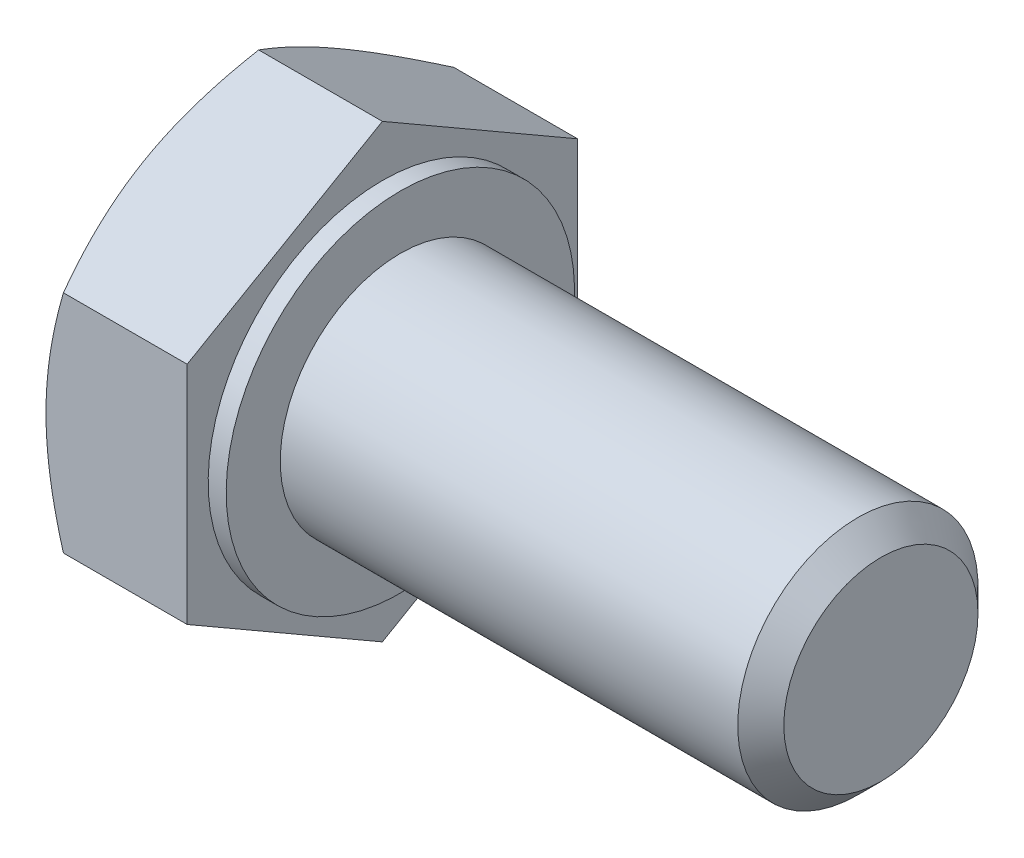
ISO-10303-21;
HEADER;
FILE_DESCRIPTION(('STEP AP214'),'2;1');
FILE_NAME('part.step','',(''),(''),'','','');
FILE_SCHEMA(('AUTOMOTIVE_DESIGN { 1 0 10303 214 1 1 1 1 }'));
ENDSEC;
DATA;
#1=APPLICATION_CONTEXT('core data for automotive mechanical design processes');
#2=APPLICATION_PROTOCOL_DEFINITION('international standard','automotive_design',2000,#1);
#3=PRODUCT_CONTEXT('',#1,'mechanical');
#4=PRODUCT('Part','Part','',(#3));
#5=PRODUCT_RELATED_PRODUCT_CATEGORY('part','',(#4));
#6=PRODUCT_DEFINITION_FORMATION('','',#4);
#7=PRODUCT_DEFINITION_CONTEXT('part definition',#1,'design');
#8=PRODUCT_DEFINITION('design','',#6,#7);
#9=PRODUCT_DEFINITION_SHAPE('','',#8);
#10=(LENGTH_UNIT() NAMED_UNIT(*) SI_UNIT(.MILLI.,.METRE.));
#11=(NAMED_UNIT(*) PLANE_ANGLE_UNIT() SI_UNIT($,.RADIAN.));
#12=(NAMED_UNIT(*) SI_UNIT($,.STERADIAN.) SOLID_ANGLE_UNIT());
#13=UNCERTAINTY_MEASURE_WITH_UNIT(LENGTH_MEASURE(1.E-05),#10,'distance_accuracy_value','');
#14=(GEOMETRIC_REPRESENTATION_CONTEXT(3) GLOBAL_UNCERTAINTY_ASSIGNED_CONTEXT((#13)) GLOBAL_UNIT_ASSIGNED_CONTEXT((#10,
#11,#12)) REPRESENTATION_CONTEXT('',''));
#15=CARTESIAN_POINT('',(0.,0.,0.));
#16=DIRECTION('',(0.,0.,1.));
#17=DIRECTION('',(1.,0.,0.));
#18=AXIS2_PLACEMENT_3D('',#15,#16,#17);
#19=CARTESIAN_POINT('',(-5.30009999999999,0.,0.));
#20=DIRECTION('',(1.,0.,0.));
#21=DIRECTION('',(0.,0.,-1.));
#22=AXIS2_PLACEMENT_3D('',#19,#20,#21);
#23=PLANE('',#22);
#24=CARTESIAN_POINT('',(-5.30010000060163,0.,0.));
#25=DIRECTION('',(1.,0.,0.));
#26=DIRECTION('',(0.,0.,-1.));
#27=AXIS2_PLACEMENT_3D('',#24,#25,#26);
#28=CIRCLE('',#27,6.50000000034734);
#29=CARTESIAN_POINT('',(-5.3001000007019,5.62916512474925,-3.25000000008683));
#30=VERTEX_POINT('',#29);
#31=CARTESIAN_POINT('',(-5.3001000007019,5.62916512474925,3.25000000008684));
#32=VERTEX_POINT('',#31);
#33=EDGE_CURVE('E323',#30,#32,#28,.T.);
#34=ORIENTED_EDGE('',*,*,#33,.F.);
#35=CARTESIAN_POINT('',(-5.30010000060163,0.,0.));
#36=DIRECTION('',(1.,0.,0.));
#37=DIRECTION('',(0.,0.,-1.));
#38=AXIS2_PLACEMENT_3D('',#35,#36,#37);
#39=CIRCLE('',#38,6.50000000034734);
#40=CARTESIAN_POINT('',(-5.3001000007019,0.,-6.50000000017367));
#41=VERTEX_POINT('',#40);
#42=EDGE_CURVE('E319',#41,#30,#39,.T.);
#43=ORIENTED_EDGE('',*,*,#42,.F.);
#44=CARTESIAN_POINT('',(-5.30010000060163,0.,0.));
#45=DIRECTION('',(1.,0.,0.));
#46=DIRECTION('',(0.,0.,-1.));
#47=AXIS2_PLACEMENT_3D('',#44,#45,#46);
#48=CIRCLE('',#47,6.50000000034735);
#49=CARTESIAN_POINT('',(-5.3001000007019,-5.62916512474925,-3.25000000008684));
#50=VERTEX_POINT('',#49);
#51=EDGE_CURVE('E315',#50,#41,#48,.T.);
#52=ORIENTED_EDGE('',*,*,#51,.F.);
#53=CARTESIAN_POINT('',(-5.30010000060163,0.,0.));
#54=DIRECTION('',(1.,0.,0.));
#55=DIRECTION('',(0.,0.,-1.));
#56=AXIS2_PLACEMENT_3D('',#53,#54,#55);
#57=CIRCLE('',#56,6.50000000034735);
#58=CARTESIAN_POINT('',(-5.3001000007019,-5.62916512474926,3.25000000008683));
#59=VERTEX_POINT('',#58);
#60=EDGE_CURVE('E90',#59,#50,#57,.T.);
#61=ORIENTED_EDGE('',*,*,#60,.F.);
#62=CARTESIAN_POINT('',(-5.30010000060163,0.,0.));
#63=DIRECTION('',(1.,0.,0.));
#64=DIRECTION('',(0.,0.,-1.));
#65=AXIS2_PLACEMENT_3D('',#62,#63,#64);
#66=CIRCLE('',#65,6.50000000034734);
#67=CARTESIAN_POINT('',(-5.3001000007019,0.,6.50000000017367));
#68=VERTEX_POINT('',#67);
#69=EDGE_CURVE('E87',#68,#59,#66,.T.);
#70=ORIENTED_EDGE('',*,*,#69,.F.);
#71=CARTESIAN_POINT('',(-5.30010000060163,0.,0.));
#72=DIRECTION('',(1.,0.,0.));
#73=DIRECTION('',(0.,0.,-1.));
#74=AXIS2_PLACEMENT_3D('',#71,#72,#73);
#75=CIRCLE('',#74,6.50000000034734);
#76=EDGE_CURVE('E19',#32,#68,#75,.T.);
#77=ORIENTED_EDGE('',*,*,#76,.F.);
#78=EDGE_LOOP('',(#34,#43,#52,#61,#70,#77));
#79=FACE_BOUND('',#78,.T.);
#80=ADVANCED_FACE('F16',(#79),#23,.F.);
#81=CARTESIAN_POINT('',(-4.71606007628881,0.,0.));
#82=DIRECTION('',(1.,0.,0.));
#83=DIRECTION('',(0.,0.,-1.));
#84=AXIS2_PLACEMENT_3D('',#81,#82,#83);
#85=CONICAL_SURFACE('',#84,7.51158682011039,1.04719755);
#86=ORIENTED_EDGE('',*,*,#76,.T.);
#87=CARTESIAN_POINT('',(-4.71954341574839,3.75277674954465,6.50000000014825));
#88=CARTESIAN_POINT('',(-4.80774841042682,3.44730232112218,6.50000000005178));
#89=CARTESIAN_POINT('',(-4.88855958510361,3.13938154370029,6.50000000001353));
#90=CARTESIAN_POINT('',(-5.03106863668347,2.52082569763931,6.49999999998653));
#91=CARTESIAN_POINT('',(-5.09286102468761,2.2102122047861,6.49999999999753));
#92=CARTESIAN_POINT('',(-5.16873158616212,1.74136052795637,6.50000000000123));
#93=CARTESIAN_POINT('',(-5.19122798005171,1.58448437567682,6.50000000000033));
#94=CARTESIAN_POINT('',(-5.23016970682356,1.26998104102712,6.49999999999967));
#95=CARTESIAN_POINT('',(-5.24661519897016,1.11235387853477,6.4999999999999));
#96=CARTESIAN_POINT('',(-5.27316617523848,0.795765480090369,6.50000000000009));
#97=CARTESIAN_POINT('',(-5.28323941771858,0.636801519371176,6.50000000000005));
#98=CARTESIAN_POINT('',(-5.29672027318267,0.31856096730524,6.49999999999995));
#99=CARTESIAN_POINT('',(-5.30012656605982,0.159284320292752,6.4999999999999));
#100=CARTESIAN_POINT('',(-5.30010000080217,1.44683826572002E-11,6.5));
#101=B_SPLINE_CURVE_WITH_KNOTS('',3,(#87,#88,#89,#90,#91,#92,#93,#94,#95,#96,#97,#98,#99,#100),
.UNSPECIFIED.,.F.,.F.,(4,2,2,2,2,2,4),(0.,0.95424765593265,1.90367376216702,2.37900973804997,
2.85433320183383,3.33204281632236,3.80984701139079),.UNSPECIFIED.);
#102=CARTESIAN_POINT('',(-4.71954341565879,3.75277674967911,6.49999999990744));
#103=VERTEX_POINT('',#102);
#104=EDGE_CURVE('E108',#103,#68,#101,.T.);
#105=ORIENTED_EDGE('',*,*,#104,.F.);
#106=CARTESIAN_POINT('',(-5.30010000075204,5.62916512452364,3.24999999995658));
#107=CARTESIAN_POINT('',(-5.30012656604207,5.54952296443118,3.38794426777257));
#108=CARTESIAN_POINT('',(-5.29672027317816,5.4698846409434,3.52588189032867));
#109=CARTESIAN_POINT('',(-5.28323941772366,5.31076436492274,3.80148629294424));
#110=CARTESIAN_POINT('',(-5.27316617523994,5.231282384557,3.93915312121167));
#111=CARTESIAN_POINT('',(-5.24661519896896,5.07298818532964,4.21332671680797));
#112=CARTESIAN_POINT('',(-5.23016970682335,4.99417460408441,4.34983584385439));
#113=CARTESIAN_POINT('',(-5.19122798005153,4.8369229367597,4.62220372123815));
#114=CARTESIAN_POINT('',(-5.16873158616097,4.75848486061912,4.75806245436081));
#115=CARTESIAN_POINT('',(-5.09286102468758,4.52405902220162,5.16409991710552));
#116=CARTESIAN_POINT('',(-5.03106863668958,4.36875227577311,5.43309909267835));
#117=CARTESIAN_POINT('',(-4.88855958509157,4.059474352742,5.96878416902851));
#118=CARTESIAN_POINT('',(-4.80774841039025,3.90551396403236,6.23545138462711));
#119=CARTESIAN_POINT('',(-4.71954341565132,3.7527767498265,6.49999999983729));
#120=B_SPLINE_CURVE_WITH_KNOTS('',3,(#106,#107,#108,#109,#110,#111,#112,#113,#114,#115,#116,
#117,#118,#119),.UNSPECIFIED.,.F.,.F.,(4,2,2,2,2,2,4),(0.,0.477804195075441,0.955513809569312,
1.43083727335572,1.90617324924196,2.85559935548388,3.80984701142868),.UNSPECIFIED.);
#121=EDGE_CURVE('E102',#32,#103,#120,.T.);
#122=ORIENTED_EDGE('',*,*,#121,.F.);
#123=EDGE_LOOP('',(#86,#105,#122));
#124=FACE_BOUND('',#123,.T.);
#125=ADVANCED_FACE('F107',(#124),#85,.T.);
#126=CARTESIAN_POINT('',(-4.71606007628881,0.,0.));
#127=DIRECTION('',(1.,0.,0.));
#128=DIRECTION('',(0.,0.,-1.));
#129=AXIS2_PLACEMENT_3D('',#126,#127,#128);
#130=CONICAL_SURFACE('',#129,7.51158682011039,1.04719755);
#131=CARTESIAN_POINT('',(-5.30010000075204,0.,6.49999999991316));
#132=CARTESIAN_POINT('',(-5.30012656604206,-0.159284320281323,6.49999999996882));
#133=CARTESIAN_POINT('',(-5.29672027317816,-0.318560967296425,6.49999999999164));
#134=CARTESIAN_POINT('',(-5.28323941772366,-0.636801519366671,6.50000000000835));
#135=CARTESIAN_POINT('',(-5.27316617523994,-0.795765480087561,6.50000000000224));
#136=CARTESIAN_POINT('',(-5.24661519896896,-1.11235387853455,6.49999999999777));
#137=CARTESIAN_POINT('',(-5.23016970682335,-1.26998104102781,6.49999999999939));
#138=CARTESIAN_POINT('',(-5.19122798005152,-1.58448437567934,6.50000000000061));
#139=CARTESIAN_POINT('',(-5.16873158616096,-1.74136052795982,6.50000000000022));
#140=CARTESIAN_POINT('',(-5.09286102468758,-2.21021220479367,6.49999999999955));
#141=CARTESIAN_POINT('',(-5.03106863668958,-2.52082569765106,6.49999999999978));
#142=CARTESIAN_POINT('',(-4.88855958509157,-3.13938154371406,6.50000000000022));
#143=CARTESIAN_POINT('',(-4.80774841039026,-3.44730232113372,6.50000000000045));
#144=CARTESIAN_POINT('',(-4.71954341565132,-3.75277674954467,6.5));
#145=B_SPLINE_CURVE_WITH_KNOTS('',3,(#131,#132,#133,#134,#135,#136,#137,#138,#139,#140,#141,
#142,#143,#144),.UNSPECIFIED.,.F.,.F.,(4,2,2,2,2,2,4),(0.,0.477804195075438,0.955513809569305,
1.43083727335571,1.90617324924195,2.85559935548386,3.80984701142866),.UNSPECIFIED.);
#146=CARTESIAN_POINT('',(-4.71954341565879,-3.75277674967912,6.49999999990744));
#147=VERTEX_POINT('',#146);
#148=EDGE_CURVE('E95',#68,#147,#145,.T.);
#149=ORIENTED_EDGE('',*,*,#148,.F.);
#150=ORIENTED_EDGE('',*,*,#69,.T.);
#151=CARTESIAN_POINT('',(-4.71954341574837,-3.75277674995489,6.49999999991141));
#152=CARTESIAN_POINT('',(-4.80774841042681,-3.90551396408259,6.23545138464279));
#153=CARTESIAN_POINT('',(-4.8885595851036,-4.05947435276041,5.96878416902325));
#154=CARTESIAN_POINT('',(-5.03106863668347,-4.36875227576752,5.43309909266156));
#155=CARTESIAN_POINT('',(-5.09286102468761,-4.52405902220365,5.16409991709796));
#156=CARTESIAN_POINT('',(-5.16873158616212,-4.75848486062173,4.75806245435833));
#157=CARTESIAN_POINT('',(-5.19122798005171,-4.83692293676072,4.62220372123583));
#158=CARTESIAN_POINT('',(-5.23016970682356,-4.99417460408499,4.34983584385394));
#159=CARTESIAN_POINT('',(-5.24661519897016,-5.07298818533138,4.21332671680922));
#160=CARTESIAN_POINT('',(-5.27316617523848,-5.23128238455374,3.93915312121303));
#161=CARTESIAN_POINT('',(-5.28323941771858,-5.3107643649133,3.80148629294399));
#162=CARTESIAN_POINT('',(-5.29672027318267,-5.46988464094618,3.52588189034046));
#163=CARTESIAN_POINT('',(-5.30012656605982,-5.54952296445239,3.38794426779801));
#164=CARTESIAN_POINT('',(-5.30010000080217,-5.62916512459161,3.25000000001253));
#165=B_SPLINE_CURVE_WITH_KNOTS('',3,(#151,#152,#153,#154,#155,#156,#157,#158,#159,#160,#161,
#162,#163,#164),.UNSPECIFIED.,.F.,.F.,(4,2,2,2,2,2,4),(0.,0.954247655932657,1.90367376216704,
2.37900973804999,2.85433320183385,3.33204281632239,3.80984701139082),.UNSPECIFIED.);
#166=EDGE_CURVE('E97',#147,#59,#165,.T.);
#167=ORIENTED_EDGE('',*,*,#166,.F.);
#168=EDGE_LOOP('',(#149,#150,#167));
#169=FACE_BOUND('',#168,.T.);
#170=ADVANCED_FACE('F96',(#169),#130,.T.);
#171=CARTESIAN_POINT('',(-4.71606007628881,0.,0.));
#172=DIRECTION('',(1.,0.,0.));
#173=DIRECTION('',(0.,0.,-1.));
#174=AXIS2_PLACEMENT_3D('',#171,#172,#173);
#175=CONICAL_SURFACE('',#174,7.51158682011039,1.04719755);
#176=CARTESIAN_POINT('',(-5.30010000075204,-5.62916512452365,3.24999999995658));
#177=CARTESIAN_POINT('',(-5.30012656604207,-5.7088072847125,3.11205573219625));
#178=CARTESIAN_POINT('',(-5.29672027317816,-5.78844560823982,2.97411810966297));
#179=CARTESIAN_POINT('',(-5.28323941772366,-5.94756588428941,2.69851370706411));
#180=CARTESIAN_POINT('',(-5.27316617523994,-6.02704786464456,2.56084687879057));
#181=CARTESIAN_POINT('',(-5.24661519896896,-6.18534206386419,2.28667328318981));
#182=CARTESIAN_POINT('',(-5.23016970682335,-6.26415564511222,2.150164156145));
#183=CARTESIAN_POINT('',(-5.19122798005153,-6.42140731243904,1.87779627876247));
#184=CARTESIAN_POINT('',(-5.16873158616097,-6.49984538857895,1.74193754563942));
#185=CARTESIAN_POINT('',(-5.09286102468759,-6.7342712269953,1.33590008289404));
#186=CARTESIAN_POINT('',(-5.03106863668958,-6.88957797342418,1.06690090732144));
#187=CARTESIAN_POINT('',(-4.88855958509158,-7.19885589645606,0.531215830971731));
#188=CARTESIAN_POINT('',(-4.80774841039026,-7.35281628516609,0.264548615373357));
#189=CARTESIAN_POINT('',(-4.71954341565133,-7.50555349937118,1.6272616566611E-10));
#190=B_SPLINE_CURVE_WITH_KNOTS('',3,(#176,#177,#178,#179,#180,#181,#182,#183,#184,#185,#186,
#187,#188,#189),.UNSPECIFIED.,.F.,.F.,(4,2,2,2,2,2,4),(0.,0.477804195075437,0.955513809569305,
1.43083727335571,1.90617324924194,2.85559935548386,3.80984701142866),.UNSPECIFIED.);
#191=CARTESIAN_POINT('',(-4.71954341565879,-7.50555349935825,0.));
#192=VERTEX_POINT('',#191);
#193=EDGE_CURVE('E113',#59,#192,#190,.T.);
#194=ORIENTED_EDGE('',*,*,#193,.F.);
#195=ORIENTED_EDGE('',*,*,#60,.T.);
#196=CARTESIAN_POINT('',(-4.71954341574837,-7.50555349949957,-2.36832132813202E-10));
#197=CARTESIAN_POINT('',(-4.80774841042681,-7.3528162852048,-0.264548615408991));
#198=CARTESIAN_POINT('',(-4.8885595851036,-7.19885589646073,-0.531215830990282));
#199=CARTESIAN_POINT('',(-5.03106863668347,-6.88957797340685,-1.06690090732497));
#200=CARTESIAN_POINT('',(-5.09286102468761,-6.73427122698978,-1.33590008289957));
#201=CARTESIAN_POINT('',(-5.16873158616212,-6.49984538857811,-1.7419375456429));
#202=CARTESIAN_POINT('',(-5.19122798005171,-6.42140731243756,-1.8777962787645));
#203=CARTESIAN_POINT('',(-5.23016970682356,-6.26415564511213,-2.15016415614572));
#204=CARTESIAN_POINT('',(-5.24661519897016,-6.18534206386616,-2.28667328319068));
#205=CARTESIAN_POINT('',(-5.27316617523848,-6.02704786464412,-2.56084687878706));
#206=CARTESIAN_POINT('',(-5.28323941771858,-5.94756588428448,-2.69851370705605));
#207=CARTESIAN_POINT('',(-5.29672027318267,-5.78844560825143,-2.97411810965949));
#208=CARTESIAN_POINT('',(-5.30012656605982,-5.70880728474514,-3.11205573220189));
#209=CARTESIAN_POINT('',(-5.30010000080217,-5.62916512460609,-3.24999999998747));
#210=B_SPLINE_CURVE_WITH_KNOTS('',3,(#196,#197,#198,#199,#200,#201,#202,#203,#204,#205,#206,
#207,#208,#209),.UNSPECIFIED.,.F.,.F.,(4,2,2,2,2,2,4),(0.,0.954247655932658,1.90367376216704,
2.37900973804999,2.85433320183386,3.33204281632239,3.80984701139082),.UNSPECIFIED.);
#211=EDGE_CURVE('E207',#192,#50,#210,.T.);
#212=ORIENTED_EDGE('',*,*,#211,.F.);
#213=EDGE_LOOP('',(#194,#195,#212));
#214=FACE_BOUND('',#213,.T.);
#215=ADVANCED_FACE('F215',(#214),#175,.T.);
#216=CARTESIAN_POINT('',(-4.71606007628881,0.,0.));
#217=DIRECTION('',(1.,0.,0.));
#218=DIRECTION('',(0.,0.,-1.));
#219=AXIS2_PLACEMENT_3D('',#216,#217,#218);
#220=CONICAL_SURFACE('',#219,7.51158682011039,1.04719755);
#221=CARTESIAN_POINT('',(-5.30010000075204,-5.62916512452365,-3.24999999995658));
#222=CARTESIAN_POINT('',(-5.30012656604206,-5.54952296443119,-3.38794426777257));
#223=CARTESIAN_POINT('',(-5.29672027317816,-5.46988464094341,-3.52588189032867));
#224=CARTESIAN_POINT('',(-5.28323941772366,-5.31076436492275,-3.80148629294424));
#225=CARTESIAN_POINT('',(-5.27316617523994,-5.23128238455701,-3.93915312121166));
#226=CARTESIAN_POINT('',(-5.24661519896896,-5.07298818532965,-4.21332671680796));
#227=CARTESIAN_POINT('',(-5.23016970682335,-4.99417460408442,-4.34983584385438));
#228=CARTESIAN_POINT('',(-5.19122798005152,-4.83692293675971,-4.62220372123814));
#229=CARTESIAN_POINT('',(-5.16873158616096,-4.75848486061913,-4.7580624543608));
#230=CARTESIAN_POINT('',(-5.09286102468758,-4.52405902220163,-5.16409991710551));
#231=CARTESIAN_POINT('',(-5.03106863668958,-4.36875227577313,-5.43309909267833));
#232=CARTESIAN_POINT('',(-4.88855958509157,-4.05947435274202,-5.96878416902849));
#233=CARTESIAN_POINT('',(-4.80774841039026,-3.90551396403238,-6.23545138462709));
#234=CARTESIAN_POINT('',(-4.71954341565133,-3.75277674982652,-6.49999999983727));
#235=B_SPLINE_CURVE_WITH_KNOTS('',3,(#221,#222,#223,#224,#225,#226,#227,#228,#229,#230,#231,
#232,#233,#234),.UNSPECIFIED.,.F.,.F.,(4,2,2,2,2,2,4),(0.,0.477804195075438,0.955513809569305,
1.43083727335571,1.90617324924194,2.85559935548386,3.80984701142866),.UNSPECIFIED.);
#236=CARTESIAN_POINT('',(-4.71954341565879,-3.75277674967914,-6.49999999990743));
#237=VERTEX_POINT('',#236);
#238=EDGE_CURVE('E219',#50,#237,#235,.T.);
#239=ORIENTED_EDGE('',*,*,#238,.F.);
#240=ORIENTED_EDGE('',*,*,#51,.T.);
#241=CARTESIAN_POINT('',(-4.71954341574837,-3.75277674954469,-6.50000000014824));
#242=CARTESIAN_POINT('',(-4.8077484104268,-3.44730232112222,-6.50000000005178));
#243=CARTESIAN_POINT('',(-4.8885595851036,-3.13938154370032,-6.50000000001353));
#244=CARTESIAN_POINT('',(-5.03106863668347,-2.52082569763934,-6.49999999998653));
#245=CARTESIAN_POINT('',(-5.09286102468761,-2.21021220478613,-6.49999999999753));
#246=CARTESIAN_POINT('',(-5.16873158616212,-1.74136052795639,-6.50000000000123));
#247=CARTESIAN_POINT('',(-5.19122798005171,-1.58448437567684,-6.50000000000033));
#248=CARTESIAN_POINT('',(-5.23016970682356,-1.26998104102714,-6.49999999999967));
#249=CARTESIAN_POINT('',(-5.24661519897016,-1.11235387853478,-6.4999999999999));
#250=CARTESIAN_POINT('',(-5.27316617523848,-0.795765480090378,-6.50000000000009));
#251=CARTESIAN_POINT('',(-5.28323941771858,-0.636801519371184,-6.50000000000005));
#252=CARTESIAN_POINT('',(-5.29672027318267,-0.318560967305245,-6.49999999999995));
#253=CARTESIAN_POINT('',(-5.30012656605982,-0.159284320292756,-6.4999999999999));
#254=CARTESIAN_POINT('',(-5.30010000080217,-1.4470694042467E-11,-6.5));
#255=B_SPLINE_CURVE_WITH_KNOTS('',3,(#241,#242,#243,#244,#245,#246,#247,#248,#249,#250,#251,
#252,#253,#254),.UNSPECIFIED.,.F.,.F.,(4,2,2,2,2,2,4),(0.,0.954247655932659,1.90367376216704,
2.37900973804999,2.85433320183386,3.3320428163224,3.80984701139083),.UNSPECIFIED.);
#256=EDGE_CURVE('E201',#237,#41,#255,.T.);
#257=ORIENTED_EDGE('',*,*,#256,.F.);
#258=EDGE_LOOP('',(#239,#240,#257));
#259=FACE_BOUND('',#258,.T.);
#260=ADVANCED_FACE('F212',(#259),#220,.T.);
#261=CARTESIAN_POINT('',(-4.71606007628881,0.,0.));
#262=DIRECTION('',(1.,0.,0.));
#263=DIRECTION('',(0.,0.,-1.));
#264=AXIS2_PLACEMENT_3D('',#261,#262,#263);
#265=CONICAL_SURFACE('',#264,7.51158682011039,1.04719755);
#266=ORIENTED_EDGE('',*,*,#42,.T.);
#267=CARTESIAN_POINT('',(-4.71954341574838,3.75277674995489,-6.49999999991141));
#268=CARTESIAN_POINT('',(-4.80774841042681,3.90551396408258,-6.23545138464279));
#269=CARTESIAN_POINT('',(-4.8885595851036,4.05947435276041,-5.96878416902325));
#270=CARTESIAN_POINT('',(-5.03106863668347,4.36875227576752,-5.43309909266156));
#271=CARTESIAN_POINT('',(-5.09286102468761,4.52405902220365,-5.16409991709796));
#272=CARTESIAN_POINT('',(-5.16873158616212,4.75848486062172,-4.75806245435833));
#273=CARTESIAN_POINT('',(-5.19122798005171,4.83692293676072,-4.62220372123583));
#274=CARTESIAN_POINT('',(-5.23016970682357,4.99417460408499,-4.34983584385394));
#275=CARTESIAN_POINT('',(-5.24661519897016,5.07298818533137,-4.21332671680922));
#276=CARTESIAN_POINT('',(-5.27316617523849,5.23128238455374,-3.93915312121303));
#277=CARTESIAN_POINT('',(-5.28323941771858,5.3107643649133,-3.80148629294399));
#278=CARTESIAN_POINT('',(-5.29672027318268,5.46988464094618,-3.52588189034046));
#279=CARTESIAN_POINT('',(-5.30012656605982,5.54952296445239,-3.38794426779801));
#280=CARTESIAN_POINT('',(-5.30010000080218,5.62916512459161,-3.25000000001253));
#281=B_SPLINE_CURVE_WITH_KNOTS('',3,(#267,#268,#269,#270,#271,#272,#273,#274,#275,#276,#277,
#278,#279,#280),.UNSPECIFIED.,.F.,.F.,(4,2,2,2,2,2,4),(0.,0.954247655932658,1.90367376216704,
2.37900973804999,2.85433320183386,3.3320428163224,3.80984701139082),.UNSPECIFIED.);
#282=CARTESIAN_POINT('',(-4.71954341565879,3.75277674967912,-6.49999999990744));
#283=VERTEX_POINT('',#282);
#284=EDGE_CURVE('E173',#283,#30,#281,.T.);
#285=ORIENTED_EDGE('',*,*,#284,.F.);
#286=CARTESIAN_POINT('',(-5.30010000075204,0.,-6.49999999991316));
#287=CARTESIAN_POINT('',(-5.30012656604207,0.15928432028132,-6.49999999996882));
#288=CARTESIAN_POINT('',(-5.29672027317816,0.318560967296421,-6.49999999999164));
#289=CARTESIAN_POINT('',(-5.28323941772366,0.636801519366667,-6.50000000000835));
#290=CARTESIAN_POINT('',(-5.27316617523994,0.795765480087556,-6.50000000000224));
#291=CARTESIAN_POINT('',(-5.24661519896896,1.11235387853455,-6.49999999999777));
#292=CARTESIAN_POINT('',(-5.23016970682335,1.26998104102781,-6.49999999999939));
#293=CARTESIAN_POINT('',(-5.19122798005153,1.58448437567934,-6.50000000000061));
#294=CARTESIAN_POINT('',(-5.16873158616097,1.74136052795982,-6.50000000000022));
#295=CARTESIAN_POINT('',(-5.09286102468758,2.21021220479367,-6.49999999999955));
#296=CARTESIAN_POINT('',(-5.03106863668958,2.52082569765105,-6.49999999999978));
#297=CARTESIAN_POINT('',(-4.88855958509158,3.13938154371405,-6.50000000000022));
#298=CARTESIAN_POINT('',(-4.80774841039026,3.44730232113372,-6.50000000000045));
#299=CARTESIAN_POINT('',(-4.71954341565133,3.75277674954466,-6.5));
#300=B_SPLINE_CURVE_WITH_KNOTS('',3,(#286,#287,#288,#289,#290,#291,#292,#293,#294,#295,#296,
#297,#298,#299),.UNSPECIFIED.,.F.,.F.,(4,2,2,2,2,2,4),(0.,0.477804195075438,0.955513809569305,
1.43083727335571,1.90617324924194,2.85559935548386,3.80984701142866),.UNSPECIFIED.);
#301=EDGE_CURVE('E196',#41,#283,#300,.T.);
#302=ORIENTED_EDGE('',*,*,#301,.F.);
#303=EDGE_LOOP('',(#266,#285,#302));
#304=FACE_BOUND('',#303,.T.);
#305=ADVANCED_FACE('F158',(#304),#265,.T.);
#306=CARTESIAN_POINT('',(-4.71606007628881,0.,0.));
#307=DIRECTION('',(1.,0.,0.));
#308=DIRECTION('',(0.,0.,-1.));
#309=AXIS2_PLACEMENT_3D('',#306,#307,#308);
#310=CONICAL_SURFACE('',#309,7.51158682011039,1.04719755);
#311=ORIENTED_EDGE('',*,*,#33,.T.);
#312=CARTESIAN_POINT('',(-4.71954341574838,7.50555349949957,2.36845423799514E-10));
#313=CARTESIAN_POINT('',(-4.80774841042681,7.3528162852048,0.264548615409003));
#314=CARTESIAN_POINT('',(-4.8885595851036,7.19885589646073,0.531215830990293));
#315=CARTESIAN_POINT('',(-5.03106863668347,6.88957797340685,1.06690090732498));
#316=CARTESIAN_POINT('',(-5.09286102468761,6.73427122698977,1.33590008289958));
#317=CARTESIAN_POINT('',(-5.16873158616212,6.49984538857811,1.74193754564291));
#318=CARTESIAN_POINT('',(-5.19122798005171,6.42140731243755,1.8777962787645));
#319=CARTESIAN_POINT('',(-5.23016970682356,6.26415564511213,2.15016415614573));
#320=CARTESIAN_POINT('',(-5.24661519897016,6.18534206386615,2.28667328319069));
#321=CARTESIAN_POINT('',(-5.27316617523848,6.02704786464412,2.56084687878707));
#322=CARTESIAN_POINT('',(-5.28323941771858,5.94756588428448,2.69851370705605));
#323=CARTESIAN_POINT('',(-5.29672027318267,5.78844560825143,2.97411810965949));
#324=CARTESIAN_POINT('',(-5.30012656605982,5.70880728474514,3.11205573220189));
#325=CARTESIAN_POINT('',(-5.30010000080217,5.62916512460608,3.24999999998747));
#326=B_SPLINE_CURVE_WITH_KNOTS('',3,(#312,#313,#314,#315,#316,#317,#318,#319,#320,#321,#322,
#323,#324,#325),.UNSPECIFIED.,.F.,.F.,(4,2,2,2,2,2,4),(0.,0.954247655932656,1.90367376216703,
2.37900973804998,2.85433320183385,3.33204281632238,3.80984701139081),.UNSPECIFIED.);
#327=CARTESIAN_POINT('',(-4.71954341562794,7.50555349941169,9.25589075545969E-11));
#328=VERTEX_POINT('',#327);
#329=EDGE_CURVE('E143',#328,#32,#326,.T.);
#330=ORIENTED_EDGE('',*,*,#329,.F.);
#331=CARTESIAN_POINT('',(-5.30010000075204,5.62916512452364,-3.24999999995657));
#332=CARTESIAN_POINT('',(-5.30012656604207,5.7088072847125,-3.11205573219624));
#333=CARTESIAN_POINT('',(-5.29672027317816,5.78844560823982,-2.97411810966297));
#334=CARTESIAN_POINT('',(-5.28323941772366,5.94756588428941,-2.69851370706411));
#335=CARTESIAN_POINT('',(-5.27316617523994,6.02704786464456,-2.56084687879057));
#336=CARTESIAN_POINT('',(-5.24661519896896,6.1853420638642,-2.28667328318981));
#337=CARTESIAN_POINT('',(-5.23016970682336,6.26415564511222,-2.150164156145));
#338=CARTESIAN_POINT('',(-5.19122798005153,6.42140731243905,-1.87779627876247));
#339=CARTESIAN_POINT('',(-5.16873158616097,6.49984538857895,-1.74193754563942));
#340=CARTESIAN_POINT('',(-5.09286102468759,6.7342712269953,-1.33590008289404));
#341=CARTESIAN_POINT('',(-5.03106863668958,6.88957797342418,-1.06690090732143));
#342=CARTESIAN_POINT('',(-4.88855958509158,7.19885589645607,-0.531215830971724));
#343=CARTESIAN_POINT('',(-4.80774841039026,7.3528162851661,-0.264548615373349));
#344=CARTESIAN_POINT('',(-4.71954341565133,7.50555349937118,-1.62717065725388E-10));
#345=B_SPLINE_CURVE_WITH_KNOTS('',3,(#331,#332,#333,#334,#335,#336,#337,#338,#339,#340,#341,
#342,#343,#344),.UNSPECIFIED.,.F.,.F.,(4,2,2,2,2,2,4),(0.,0.477804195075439,0.955513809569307,
1.43083727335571,1.90617324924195,2.85559935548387,3.80984701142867),.UNSPECIFIED.);
#346=EDGE_CURVE('E164',#30,#328,#345,.T.);
#347=ORIENTED_EDGE('',*,*,#346,.F.);
#348=EDGE_LOOP('',(#311,#330,#347));
#349=FACE_BOUND('',#348,.T.);
#350=ADVANCED_FACE('F152',(#349),#310,.T.);
#351=CARTESIAN_POINT('',(-0.600099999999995,7.50555349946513,0.));
#352=DIRECTION('',(0.,0.866025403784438,0.500000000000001));
#353=DIRECTION('',(0.,-0.500000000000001,0.866025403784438));
#354=AXIS2_PLACEMENT_3D('',#351,#352,#353);
#355=PLANE('',#354);
#356=DIRECTION('',(0.,-0.500000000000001,0.866025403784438));
#357=VECTOR('',#356,1.);
#358=CARTESIAN_POINT('',(-0.600099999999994,7.50555349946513,0.));
#359=LINE('',#358,#357);
#360=CARTESIAN_POINT('',(-0.600099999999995,7.50555349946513,0.));
#361=VERTEX_POINT('',#360);
#362=CARTESIAN_POINT('',(-0.600099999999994,3.75277674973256,6.5));
#363=VERTEX_POINT('',#362);
#364=EDGE_CURVE('E284',#361,#363,#359,.T.);
#365=ORIENTED_EDGE('',*,*,#364,.F.);
#366=DIRECTION('',(1.,0.,0.));
#367=VECTOR('',#366,1.);
#368=CARTESIAN_POINT('',(-0.600099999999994,7.50555349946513,0.));
#369=LINE('',#368,#367);
#370=EDGE_CURVE('E172',#328,#361,#369,.T.);
#371=ORIENTED_EDGE('',*,*,#370,.F.);
#372=ORIENTED_EDGE('',*,*,#329,.T.);
#373=ORIENTED_EDGE('',*,*,#121,.T.);
#374=DIRECTION('',(1.,0.,0.));
#375=VECTOR('',#374,1.);
#376=CARTESIAN_POINT('',(-0.600099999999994,3.75277674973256,6.5));
#377=LINE('',#376,#375);
#378=EDGE_CURVE('E101',#363,#103,#377,.F.);
#379=ORIENTED_EDGE('',*,*,#378,.F.);
#380=EDGE_LOOP('',(#365,#371,#372,#373,#379));
#381=FACE_BOUND('',#380,.T.);
#382=ADVANCED_FACE('F149',(#381),#355,.T.);
#383=CARTESIAN_POINT('',(-0.600099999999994,3.75277674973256,6.5));
#384=DIRECTION('',(0.,0.,1.));
#385=DIRECTION('',(1.,0.,0.));
#386=AXIS2_PLACEMENT_3D('',#383,#384,#385);
#387=PLANE('',#386);
#388=ORIENTED_EDGE('',*,*,#378,.T.);
#389=ORIENTED_EDGE('',*,*,#104,.T.);
#390=ORIENTED_EDGE('',*,*,#148,.T.);
#391=DIRECTION('',(1.,0.,0.));
#392=VECTOR('',#391,1.);
#393=CARTESIAN_POINT('',(-0.600099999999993,-3.75277674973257,6.49999999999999));
#394=LINE('',#393,#392);
#395=CARTESIAN_POINT('',(-0.600099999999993,-3.75277674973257,6.5));
#396=VERTEX_POINT('',#395);
#397=EDGE_CURVE('E115',#396,#147,#394,.F.);
#398=ORIENTED_EDGE('',*,*,#397,.F.);
#399=DIRECTION('',(0.,1.,0.));
#400=VECTOR('',#399,1.);
#401=CARTESIAN_POINT('',(-0.600099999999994,0.,6.5));
#402=LINE('',#401,#400);
#403=EDGE_CURVE('E280',#363,#396,#402,.F.);
#404=ORIENTED_EDGE('',*,*,#403,.F.);
#405=EDGE_LOOP('',(#388,#389,#390,#398,#404));
#406=FACE_BOUND('',#405,.T.);
#407=ADVANCED_FACE('F111',(#406),#387,.T.);
#408=CARTESIAN_POINT('',(-0.600099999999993,-3.75277674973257,6.49999999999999));
#409=DIRECTION('',(0.,-0.866025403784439,0.499999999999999));
#410=DIRECTION('',(0.,-0.499999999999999,-0.866025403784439));
#411=AXIS2_PLACEMENT_3D('',#408,#409,#410);
#412=PLANE('',#411);
#413=ORIENTED_EDGE('',*,*,#397,.T.);
#414=ORIENTED_EDGE('',*,*,#166,.T.);
#415=ORIENTED_EDGE('',*,*,#193,.T.);
#416=DIRECTION('',(1.,0.,0.));
#417=VECTOR('',#416,1.);
#418=CARTESIAN_POINT('',(-0.600099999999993,-7.50555349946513,0.));
#419=LINE('',#418,#417);
#420=CARTESIAN_POINT('',(-0.600099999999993,-7.50555349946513,0.));
#421=VERTEX_POINT('',#420);
#422=EDGE_CURVE('E224',#421,#192,#419,.F.);
#423=ORIENTED_EDGE('',*,*,#422,.F.);
#424=DIRECTION('',(0.,-0.499999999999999,-0.866025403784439));
#425=VECTOR('',#424,1.);
#426=CARTESIAN_POINT('',(-0.600099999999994,-3.75277674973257,6.49999999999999));
#427=LINE('',#426,#425);
#428=EDGE_CURVE('E283',#396,#421,#427,.T.);
#429=ORIENTED_EDGE('',*,*,#428,.F.);
#430=EDGE_LOOP('',(#413,#414,#415,#423,#429));
#431=FACE_BOUND('',#430,.T.);
#432=ADVANCED_FACE('F228',(#431),#412,.T.);
#433=CARTESIAN_POINT('',(-0.600099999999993,-7.50555349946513,0.));
#434=DIRECTION('',(0.,-0.866025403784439,-0.5));
#435=DIRECTION('',(0.,0.5,-0.866025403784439));
#436=AXIS2_PLACEMENT_3D('',#433,#434,#435);
#437=PLANE('',#436);
#438=ORIENTED_EDGE('',*,*,#422,.T.);
#439=ORIENTED_EDGE('',*,*,#211,.T.);
#440=ORIENTED_EDGE('',*,*,#238,.T.);
#441=DIRECTION('',(-1.,0.,0.));
#442=VECTOR('',#441,1.);
#443=CARTESIAN_POINT('',(-0.600099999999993,-3.75277674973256,-6.5));
#444=LINE('',#443,#442);
#445=CARTESIAN_POINT('',(-0.600099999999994,-3.75277674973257,-6.5));
#446=VERTEX_POINT('',#445);
#447=EDGE_CURVE('E300',#446,#237,#444,.T.);
#448=ORIENTED_EDGE('',*,*,#447,.F.);
#449=DIRECTION('',(0.,0.5,-0.866025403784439));
#450=VECTOR('',#449,1.);
#451=CARTESIAN_POINT('',(-0.600099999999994,-7.50555349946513,0.));
#452=LINE('',#451,#450);
#453=EDGE_CURVE('E287',#421,#446,#452,.T.);
#454=ORIENTED_EDGE('',*,*,#453,.F.);
#455=EDGE_LOOP('',(#438,#439,#440,#448,#454));
#456=FACE_BOUND('',#455,.T.);
#457=ADVANCED_FACE('F193',(#456),#437,.T.);
#458=CARTESIAN_POINT('',(-0.600099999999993,-3.75277674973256,-6.5));
#459=DIRECTION('',(0.,0.,-1.));
#460=DIRECTION('',(-1.,0.,0.));
#461=AXIS2_PLACEMENT_3D('',#458,#459,#460);
#462=PLANE('',#461);
#463=DIRECTION('',(0.,1.,0.));
#464=VECTOR('',#463,1.);
#465=CARTESIAN_POINT('',(-0.600099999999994,0.,-6.5));
#466=LINE('',#465,#464);
#467=CARTESIAN_POINT('',(-0.600099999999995,3.75277674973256,-6.49999999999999));
#468=VERTEX_POINT('',#467);
#469=EDGE_CURVE('E290',#446,#468,#466,.T.);
#470=ORIENTED_EDGE('',*,*,#469,.F.);
#471=ORIENTED_EDGE('',*,*,#447,.T.);
#472=ORIENTED_EDGE('',*,*,#256,.T.);
#473=ORIENTED_EDGE('',*,*,#301,.T.);
#474=DIRECTION('',(1.,0.,0.));
#475=VECTOR('',#474,1.);
#476=CARTESIAN_POINT('',(-0.600099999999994,3.75277674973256,-6.49999999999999));
#477=LINE('',#476,#475);
#478=EDGE_CURVE('E34',#468,#283,#477,.F.);
#479=ORIENTED_EDGE('',*,*,#478,.F.);
#480=EDGE_LOOP('',(#470,#471,#472,#473,#479));
#481=FACE_BOUND('',#480,.T.);
#482=ADVANCED_FACE('F186',(#481),#462,.T.);
#483=CARTESIAN_POINT('',(-0.600099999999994,3.75277674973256,-6.49999999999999));
#484=DIRECTION('',(0.,0.866025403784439,-0.5));
#485=DIRECTION('',(0.,0.5,0.866025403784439));
#486=AXIS2_PLACEMENT_3D('',#483,#484,#485);
#487=PLANE('',#486);
#488=DIRECTION('',(0.,0.5,0.866025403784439));
#489=VECTOR('',#488,1.);
#490=CARTESIAN_POINT('',(-0.600099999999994,3.75277674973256,-6.49999999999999));
#491=LINE('',#490,#489);
#492=EDGE_CURVE('E276',#468,#361,#491,.T.);
#493=ORIENTED_EDGE('',*,*,#492,.F.);
#494=ORIENTED_EDGE('',*,*,#478,.T.);
#495=ORIENTED_EDGE('',*,*,#284,.T.);
#496=ORIENTED_EDGE('',*,*,#346,.T.);
#497=ORIENTED_EDGE('',*,*,#370,.T.);
#498=EDGE_LOOP('',(#493,#494,#495,#496,#497));
#499=FACE_BOUND('',#498,.T.);
#500=ADVANCED_FACE('F180',(#499),#487,.T.);
#501=CARTESIAN_POINT('',(-0.600099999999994,0.,0.));
#502=DIRECTION('',(1.,0.,0.));
#503=DIRECTION('',(0.,0.,-1.));
#504=AXIS2_PLACEMENT_3D('',#501,#502,#503);
#505=PLANE('',#504);
#506=CARTESIAN_POINT('',(-0.600099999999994,0.,0.));
#507=DIRECTION('',(1.,0.,0.));
#508=DIRECTION('',(0.,1.,0.));
#509=AXIS2_PLACEMENT_3D('',#506,#507,#508);
#510=CIRCLE('',#509,5.8);
#511=CARTESIAN_POINT('',(-0.600099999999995,5.8,0.));
#512=VERTEX_POINT('',#511);
#513=EDGE_CURVE('E174',#512,#512,#510,.T.);
#514=ORIENTED_EDGE('',*,*,#513,.F.);
#515=EDGE_LOOP('',(#514));
#516=FACE_BOUND('',#515,.T.);
#517=ORIENTED_EDGE('',*,*,#469,.T.);
#518=ORIENTED_EDGE('',*,*,#492,.T.);
#519=ORIENTED_EDGE('',*,*,#364,.T.);
#520=ORIENTED_EDGE('',*,*,#403,.T.);
#521=ORIENTED_EDGE('',*,*,#428,.T.);
#522=ORIENTED_EDGE('',*,*,#453,.T.);
#523=EDGE_LOOP('',(#517,#518,#519,#520,#521,#522));
#524=FACE_BOUND('',#523,.T.);
#525=ADVANCED_FACE('F185',(#516,#524),#505,.T.);
#526=CARTESIAN_POINT('',(-0.300049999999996,0.,0.));
#527=DIRECTION('',(1.,0.,0.));
#528=DIRECTION('',(0.,1.,0.));
#529=AXIS2_PLACEMENT_3D('',#526,#527,#528);
#530=CYLINDRICAL_SURFACE('',#529,5.8);
#531=ORIENTED_EDGE('',*,*,#513,.T.);
#532=EDGE_LOOP('',(#531));
#533=FACE_BOUND('',#532,.T.);
#534=CARTESIAN_POINT('',(0.,0.,0.));
#535=DIRECTION('',(1.,0.,0.));
#536=DIRECTION('',(0.,1.,0.));
#537=AXIS2_PLACEMENT_3D('',#534,#535,#536);
#538=CIRCLE('',#537,5.8);
#539=CARTESIAN_POINT('',(0.,5.8,0.));
#540=VERTEX_POINT('',#539);
#541=EDGE_CURVE('E271',#540,#540,#538,.T.);
#542=ORIENTED_EDGE('',*,*,#541,.F.);
#543=EDGE_LOOP('',(#542));
#544=FACE_BOUND('',#543,.T.);
#545=ADVANCED_FACE('F258',(#533,#544),#530,.T.);
#546=CARTESIAN_POINT('',(16.,2.,0.));
#547=DIRECTION('',(1.,0.,0.));
#548=DIRECTION('',(0.,0.,-1.));
#549=AXIS2_PLACEMENT_3D('',#546,#547,#548);
#550=PLANE('',#549);
#551=CARTESIAN_POINT('',(16.0000000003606,0.,0.));
#552=DIRECTION('',(-1.,0.,0.));
#553=DIRECTION('',(0.,-1.,0.));
#554=AXIS2_PLACEMENT_3D('',#551,#552,#553);
#555=CIRCLE('',#554,3.23318750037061);
#556=CARTESIAN_POINT('',(16.0000000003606,-3.23318750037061,0.));
#557=VERTEX_POINT('',#556);
#558=EDGE_CURVE('E273',#557,#557,#555,.T.);
#559=ORIENTED_EDGE('',*,*,#558,.F.);
#560=EDGE_LOOP('',(#559));
#561=FACE_BOUND('',#560,.T.);
#562=ADVANCED_FACE('F255',(#561),#550,.T.);
#563=CARTESIAN_POINT('',(0.,4.9,0.));
#564=DIRECTION('',(1.,0.,0.));
#565=DIRECTION('',(0.,0.,-1.));
#566=AXIS2_PLACEMENT_3D('',#563,#564,#565);
#567=PLANE('',#566);
#568=CARTESIAN_POINT('',(0.,0.,0.));
#569=DIRECTION('',(1.,0.,0.));
#570=DIRECTION('',(0.,1.,0.));
#571=AXIS2_PLACEMENT_3D('',#568,#569,#570);
#572=CIRCLE('',#571,4.);
#573=CARTESIAN_POINT('',(0.,4.,0.));
#574=VERTEX_POINT('',#573);
#575=EDGE_CURVE('E25',#574,#574,#572,.T.);
#576=ORIENTED_EDGE('',*,*,#575,.F.);
#577=EDGE_LOOP('',(#576));
#578=FACE_BOUND('',#577,.T.);
#579=ORIENTED_EDGE('',*,*,#541,.T.);
#580=EDGE_LOOP('',(#579));
#581=FACE_BOUND('',#580,.T.);
#582=ADVANCED_FACE('F248',(#578,#581),#567,.T.);
#583=CARTESIAN_POINT('',(15.2330874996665,0.,0.));
#584=DIRECTION('',(-1.,0.,0.));
#585=DIRECTION('',(0.,-1.,0.));
#586=AXIS2_PLACEMENT_3D('',#583,#584,#585);
#587=CONICAL_SURFACE('',#586,3.99999999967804,0.78533296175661);
#588=ORIENTED_EDGE('',*,*,#558,.T.);
#589=EDGE_LOOP('',(#588));
#590=FACE_BOUND('',#589,.T.);
#591=CARTESIAN_POINT('',(15.2330875,0.,0.));
#592=DIRECTION('',(1.,0.,0.));
#593=DIRECTION('',(0.,1.,0.));
#594=AXIS2_PLACEMENT_3D('',#591,#592,#593);
#595=CIRCLE('',#594,4.);
#596=CARTESIAN_POINT('',(15.2330875,4.,0.));
#597=VERTEX_POINT('',#596);
#598=EDGE_CURVE('E11',#597,#597,#595,.F.);
#599=ORIENTED_EDGE('',*,*,#598,.F.);
#600=EDGE_LOOP('',(#599));
#601=FACE_BOUND('',#600,.T.);
#602=ADVANCED_FACE('F241',(#590,#601),#587,.T.);
#603=CARTESIAN_POINT('',(8.5,0.,0.));
#604=DIRECTION('',(1.,0.,0.));
#605=DIRECTION('',(0.,1.,0.));
#606=AXIS2_PLACEMENT_3D('',#603,#604,#605);
#607=CYLINDRICAL_SURFACE('',#606,4.);
#608=ORIENTED_EDGE('',*,*,#598,.T.);
#609=EDGE_LOOP('',(#608));
#610=FACE_BOUND('',#609,.T.);
#611=ORIENTED_EDGE('',*,*,#575,.T.);
#612=EDGE_LOOP('',(#611));
#613=FACE_BOUND('',#612,.T.);
#614=ADVANCED_FACE('F239',(#610,#613),#607,.T.);
#615=CLOSED_SHELL('',(#80,#125,#170,#215,#260,#305,#350,#382,#407,#432,#457,#482,#500,#525,#545,
#562,#582,#602,#614));
#616=MANIFOLD_SOLID_BREP('B1',#615);
#617=ADVANCED_BREP_SHAPE_REPRESENTATION('',(#18,#616),#14);
#618=SHAPE_DEFINITION_REPRESENTATION(#9,#617);
ENDSEC;
END-ISO-10303-21;
